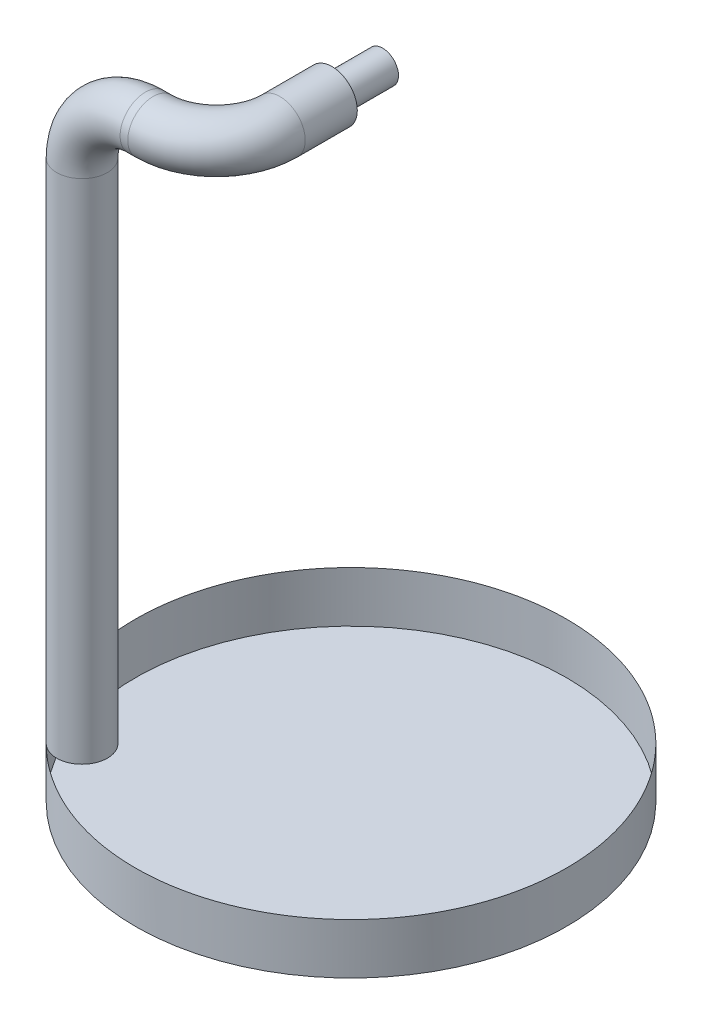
from build123d import *

# Parameters (mm, degrees)
ESQUISSE2_R      = 4
ESQUISSE3_R      = 2.5
EXTRUSION1_DEPTH = 8
ESQUISSE4_R      = 34
EXTRUSION2_DEPTH = 8


with BuildPart() as part:
    # Balayage1: sweep along a curve in space
    with BuildLine() as balayage1_path:
        Line((0, 0, 0), (0, 80, 0))
        ThreePointArc((0, 80, 0), (2.928932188, 87.071067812, 0), (10, 90, 0))
        Line((10, 90, 0), (11.21, 90, 0))
        ThreePointArc((11.21, 90, 0), (18.281067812, 90, -2.928932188), (21.21, 90, -10))
        Line((21.21, 90, -10), (21.21, 90, -18.21))
    # Esquisse2 → Balayage1 (sweep)
    with BuildSketch(Plane(origin=(0, 0, 0), x_dir=(1, 0, 0), z_dir=(0, 1, 0))):
        Circle(ESQUISSE2_R)
    sweep(path=balayage1_path.line)

    # Esquisse3 → Extrusion1 (add)
    with BuildSketch(Plane(origin=(0, 0, -18.21), x_dir=(-1, 0, 0), z_dir=(0, 0, -1))):
        with Locations((-21.21, 90)):
            Circle(ESQUISSE3_R)
    extrude(amount=EXTRUSION1_DEPTH)

    # Esquisse4 → Extrusion2 (add)
    with BuildSketch(Plane.XZ):
        with Locations(Location((21.213203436, -21.213203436, 0), (0, 0, 135))):
            Circle(ESQUISSE4_R)
    extrude(amount=EXTRUSION2_DEPTH)


solid = part.part
